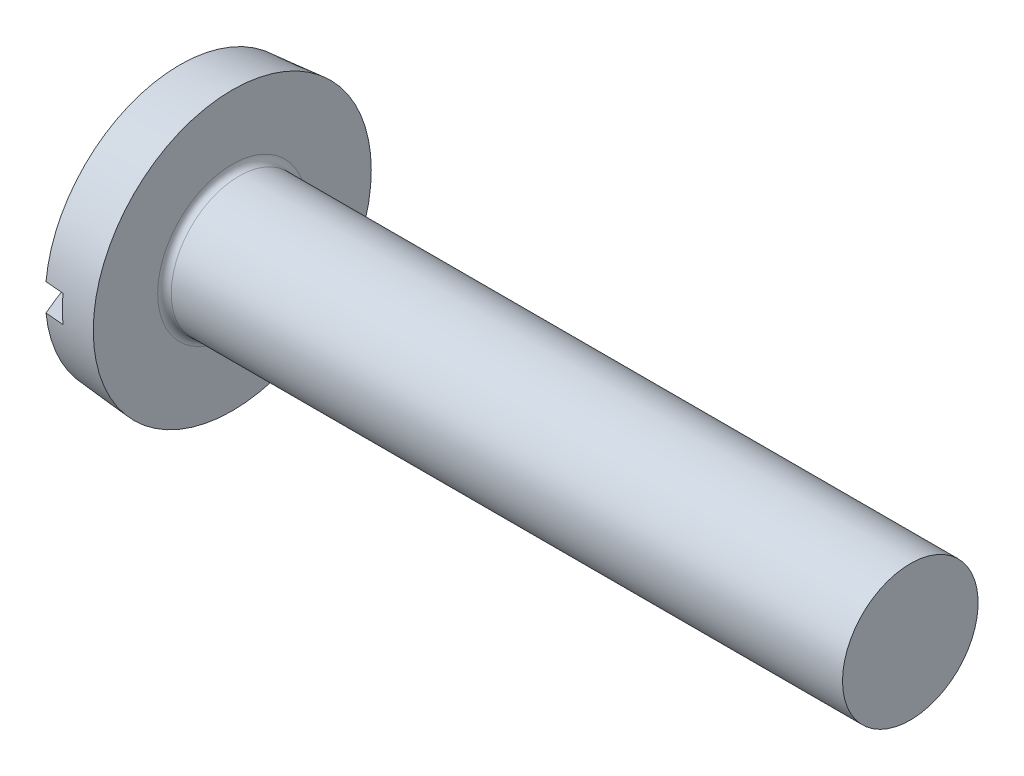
ISO-10303-21;
HEADER;
FILE_DESCRIPTION(('STEP AP214'),'2;1');
FILE_NAME('part.step','',(''),(''),'','','');
FILE_SCHEMA(('AUTOMOTIVE_DESIGN { 1 0 10303 214 1 1 1 1 }'));
ENDSEC;
DATA;
#1=APPLICATION_CONTEXT('core data for automotive mechanical design processes');
#2=APPLICATION_PROTOCOL_DEFINITION('international standard','automotive_design',2000,#1);
#3=PRODUCT_CONTEXT('',#1,'mechanical');
#4=PRODUCT('Part','Part','',(#3));
#5=PRODUCT_RELATED_PRODUCT_CATEGORY('part','',(#4));
#6=PRODUCT_DEFINITION_FORMATION('','',#4);
#7=PRODUCT_DEFINITION_CONTEXT('part definition',#1,'design');
#8=PRODUCT_DEFINITION('design','',#6,#7);
#9=PRODUCT_DEFINITION_SHAPE('','',#8);
#10=(LENGTH_UNIT() NAMED_UNIT(*) SI_UNIT(.MILLI.,.METRE.));
#11=(NAMED_UNIT(*) PLANE_ANGLE_UNIT() SI_UNIT($,.RADIAN.));
#12=(NAMED_UNIT(*) SI_UNIT($,.STERADIAN.) SOLID_ANGLE_UNIT());
#13=UNCERTAINTY_MEASURE_WITH_UNIT(LENGTH_MEASURE(1.E-05),#10,'distance_accuracy_value','');
#14=(GEOMETRIC_REPRESENTATION_CONTEXT(3) GLOBAL_UNCERTAINTY_ASSIGNED_CONTEXT((#13)) GLOBAL_UNIT_ASSIGNED_CONTEXT((#10,
#11,#12)) REPRESENTATION_CONTEXT('',''));
#15=CARTESIAN_POINT('',(0.,0.,0.));
#16=DIRECTION('',(0.,0.,1.));
#17=DIRECTION('',(1.,0.,0.));
#18=AXIS2_PLACEMENT_3D('',#15,#16,#17);
#19=CARTESIAN_POINT('',(19.3398923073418,0.,0.));
#20=DIRECTION('',(-1.,0.,0.));
#21=DIRECTION('',(0.,1.,0.));
#22=AXIS2_PLACEMENT_3D('',#19,#20,#21);
#23=SPHERICAL_SURFACE('',#22,19.3398923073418);
#24=CARTESIAN_POINT('',(19.3398923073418,0.8,0.));
#25=DIRECTION('',(0.,-1.,0.));
#26=DIRECTION('',(0.,0.,-1.));
#27=AXIS2_PLACEMENT_3D('',#24,#25,#26);
#28=CIRCLE('',#27,19.3233391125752);
#29=CARTESIAN_POINT('',(1.7,0.799999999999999,7.88832262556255));
#30=VERTEX_POINT('',#29);
#31=CARTESIAN_POINT('',(1.7,0.800000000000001,-7.88832262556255));
#32=VERTEX_POINT('',#31);
#33=EDGE_CURVE('E61',#30,#32,#28,.T.);
#34=ORIENTED_EDGE('',*,*,#33,.F.);
#35=CARTESIAN_POINT('',(1.7,0.,0.));
#36=DIRECTION('',(-1.,0.,0.));
#37=DIRECTION('',(0.,0.,1.));
#38=AXIS2_PLACEMENT_3D('',#35,#36,#37);
#39=CIRCLE('',#38,7.92878514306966);
#40=EDGE_CURVE('E105',#30,#32,#39,.T.);
#41=ORIENTED_EDGE('',*,*,#40,.T.);
#42=EDGE_LOOP('',(#34,#41));
#43=FACE_BOUND('',#42,.T.);
#44=ADVANCED_FACE('F33',(#43),#23,.T.);
#45=CARTESIAN_POINT('',(19.3398923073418,-0.8,0.));
#46=DIRECTION('',(0.,1.,0.));
#47=DIRECTION('',(0.,0.,1.));
#48=AXIS2_PLACEMENT_3D('',#45,#46,#47);
#49=CIRCLE('',#48,19.3233391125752);
#50=CARTESIAN_POINT('',(1.7,-0.799999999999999,-7.88832262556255));
#51=VERTEX_POINT('',#50);
#52=CARTESIAN_POINT('',(1.7,-0.800000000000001,7.88832262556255));
#53=VERTEX_POINT('',#52);
#54=EDGE_CURVE('E117',#51,#53,#49,.T.);
#55=ORIENTED_EDGE('',*,*,#54,.F.);
#56=EDGE_CURVE('E109',#51,#53,#39,.T.);
#57=ORIENTED_EDGE('',*,*,#56,.T.);
#58=EDGE_LOOP('',(#55,#57));
#59=FACE_BOUND('',#58,.T.);
#60=ADVANCED_FACE('F126',(#59),#23,.T.);
#61=CARTESIAN_POINT('',(4.8,0.,0.));
#62=DIRECTION('',(1.,0.,0.));
#63=DIRECTION('',(0.,0.,-1.));
#64=AXIS2_PLACEMENT_3D('',#61,#62,#63);
#65=CONICAL_SURFACE('',#64,8.2,0.0872664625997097);
#66=CARTESIAN_POINT('',(4.8,0.,0.));
#67=DIRECTION('',(-1.,0.,0.));
#68=DIRECTION('',(0.,0.,1.));
#69=AXIS2_PLACEMENT_3D('',#66,#67,#68);
#70=CIRCLE('',#69,8.2);
#71=CARTESIAN_POINT('',(4.8,0.,8.2));
#72=VERTEX_POINT('',#71);
#73=EDGE_CURVE('E110',#72,#72,#70,.T.);
#74=ORIENTED_EDGE('',*,*,#73,.T.);
#75=EDGE_LOOP('',(#74));
#76=FACE_BOUND('',#75,.T.);
#77=CARTESIAN_POINT('',(-12.4996188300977,0.800000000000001,-6.63844919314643));
#78=CARTESIAN_POINT('',(-8.41515626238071,0.800000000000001,-6.99836247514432));
#79=CARTESIAN_POINT('',(-4.33066054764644,0.800000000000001,-7.35789922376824));
#80=CARTESIAN_POINT('',(0.533772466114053,0.800000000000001,-7.78576416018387));
#81=CARTESIAN_POINT('',(1.31368676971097,0.800000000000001,-7.85435375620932));
#82=CARTESIAN_POINT('',(6.95804533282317,0.800000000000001,-8.35068030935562));
#83=CARTESIAN_POINT('',(11.8225201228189,0.800000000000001,-8.77807012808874));
#84=CARTESIAN_POINT('',(16.6870105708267,0.800000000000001,-9.20528140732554));
#85=B_SPLINE_CURVE_WITH_KNOTS('',3,(#77,#78,#79,#80,#81,#82,#83,#84),.UNSPECIFIED.,.F.,.F.,(4,2,
2,4),(0.,12.3008677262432,14.6496413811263,29.2992827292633),.UNSPECIFIED.);
#86=CARTESIAN_POINT('',(2.8,0.800000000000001,-7.98504783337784));
#87=VERTEX_POINT('',#86);
#88=EDGE_CURVE('E11',#32,#87,#85,.T.);
#89=ORIENTED_EDGE('',*,*,#88,.F.);
#90=ORIENTED_EDGE('',*,*,#40,.F.);
#91=CARTESIAN_POINT('',(16.6870105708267,0.799999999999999,9.20528140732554));
#92=CARTESIAN_POINT('',(14.2547646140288,0.799999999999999,8.99168400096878));
#93=CARTESIAN_POINT('',(11.8225232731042,0.799999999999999,8.77803401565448));
#94=CARTESIAN_POINT('',(6.95805274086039,0.799999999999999,8.35059593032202));
#95=CARTESIAN_POINT('',(4.52582354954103,0.799999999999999,8.13680783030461));
#96=CARTESIAN_POINT('',(-0.338619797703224,0.799999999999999,7.70906055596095));
#97=CARTESIAN_POINT('',(-2.77083395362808,0.799999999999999,7.49510138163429));
#98=CARTESIAN_POINT('',(-7.63524245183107,0.799999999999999,7.06695777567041));
#99=CARTESIAN_POINT('',(-10.0674367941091,0.799999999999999,6.85277334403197));
#100=CARTESIAN_POINT('',(-12.4996188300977,0.799999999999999,6.63844919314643));
#101=B_SPLINE_CURVE_WITH_KNOTS('',3,(#91,#92,#93,#94,#95,#96,#97,#98,#99,#100),.UNSPECIFIED.,
.F.,.F.,(4,2,2,2,4),(0.,7.32482069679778,14.6496413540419,21.9744620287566,29.2992827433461),.UNSPECIFIED.);
#102=CARTESIAN_POINT('',(2.8,0.799999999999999,7.98504783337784));
#103=VERTEX_POINT('',#102);
#104=EDGE_CURVE('E93',#103,#30,#101,.T.);
#105=ORIENTED_EDGE('',*,*,#104,.F.);
#106=CARTESIAN_POINT('',(2.8,0.,0.));
#107=DIRECTION('',(-1.,0.,0.));
#108=DIRECTION('',(0.,0.,1.));
#109=AXIS2_PLACEMENT_3D('',#106,#107,#108);
#110=CIRCLE('',#109,8.02502267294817);
#111=CARTESIAN_POINT('',(2.8,-0.800000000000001,7.98504783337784));
#112=VERTEX_POINT('',#111);
#113=EDGE_CURVE('E88',#112,#103,#110,.T.);
#114=ORIENTED_EDGE('',*,*,#113,.F.);
#115=CARTESIAN_POINT('',(-12.4996188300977,-0.800000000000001,6.63844919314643));
#116=CARTESIAN_POINT('',(-8.41515626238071,-0.800000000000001,6.99836247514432));
#117=CARTESIAN_POINT('',(-4.33066054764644,-0.800000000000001,7.35789922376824));
#118=CARTESIAN_POINT('',(0.533772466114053,-0.800000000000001,7.78576416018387));
#119=CARTESIAN_POINT('',(1.31368676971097,-0.800000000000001,7.85435375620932));
#120=CARTESIAN_POINT('',(6.95804533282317,-0.800000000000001,8.35068030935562));
#121=CARTESIAN_POINT('',(11.8225201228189,-0.800000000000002,8.77807012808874));
#122=CARTESIAN_POINT('',(16.6870105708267,-0.800000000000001,9.20528140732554));
#123=B_SPLINE_CURVE_WITH_KNOTS('',3,(#115,#116,#117,#118,#119,#120,#121,#122),.UNSPECIFIED.,.F.,
.F.,(4,2,2,4),(0.,12.3008677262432,14.6496413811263,29.2992827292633),.UNSPECIFIED.);
#124=EDGE_CURVE('E95',#53,#112,#123,.T.);
#125=ORIENTED_EDGE('',*,*,#124,.F.);
#126=ORIENTED_EDGE('',*,*,#56,.F.);
#127=CARTESIAN_POINT('',(16.6870105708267,-0.799999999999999,-9.20528140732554));
#128=CARTESIAN_POINT('',(14.2547646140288,-0.799999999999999,-8.99168400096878));
#129=CARTESIAN_POINT('',(11.8225232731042,-0.799999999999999,-8.77803401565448));
#130=CARTESIAN_POINT('',(6.95805274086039,-0.799999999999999,-8.35059593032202));
#131=CARTESIAN_POINT('',(4.52582354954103,-0.799999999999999,-8.13680783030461));
#132=CARTESIAN_POINT('',(-0.338619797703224,-0.799999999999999,-7.70906055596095));
#133=CARTESIAN_POINT('',(-2.77083395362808,-0.799999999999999,-7.49510138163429));
#134=CARTESIAN_POINT('',(-7.63524245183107,-0.799999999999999,-7.06695777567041));
#135=CARTESIAN_POINT('',(-10.0674367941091,-0.799999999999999,-6.85277334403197));
#136=CARTESIAN_POINT('',(-12.4996188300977,-0.799999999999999,-6.63844919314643));
#137=B_SPLINE_CURVE_WITH_KNOTS('',3,(#127,#128,#129,#130,#131,#132,#133,#134,#135,#136),
.UNSPECIFIED.,.F.,.F.,(4,2,2,2,4),(0.,7.32482069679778,14.6496413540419,21.9744620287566,
29.2992827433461),.UNSPECIFIED.);
#138=CARTESIAN_POINT('',(2.8,-0.799999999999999,-7.98504783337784));
#139=VERTEX_POINT('',#138);
#140=EDGE_CURVE('E47',#139,#51,#137,.T.);
#141=ORIENTED_EDGE('',*,*,#140,.F.);
#142=EDGE_CURVE('E86',#87,#139,#110,.T.);
#143=ORIENTED_EDGE('',*,*,#142,.F.);
#144=EDGE_LOOP('',(#89,#90,#105,#114,#125,#126,#141,#143));
#145=FACE_BOUND('',#144,.T.);
#146=ADVANCED_FACE('F91',(#76,#145),#65,.T.);
#147=CARTESIAN_POINT('',(4.8,8.2,0.));
#148=DIRECTION('',(-1.,0.,0.));
#149=DIRECTION('',(0.,0.,1.));
#150=AXIS2_PLACEMENT_3D('',#147,#148,#149);
#151=PLANE('',#150);
#152=CARTESIAN_POINT('',(4.8,0.,0.));
#153=DIRECTION('',(-1.,0.,0.));
#154=DIRECTION('',(0.,0.,1.));
#155=AXIS2_PLACEMENT_3D('',#152,#153,#154);
#156=CIRCLE('',#155,4.4);
#157=CARTESIAN_POINT('',(4.8,0.,4.4));
#158=VERTEX_POINT('',#157);
#159=EDGE_CURVE('E101',#158,#158,#156,.T.);
#160=ORIENTED_EDGE('',*,*,#159,.T.);
#161=EDGE_LOOP('',(#160));
#162=FACE_BOUND('',#161,.T.);
#163=ORIENTED_EDGE('',*,*,#73,.F.);
#164=EDGE_LOOP('',(#163));
#165=FACE_BOUND('',#164,.T.);
#166=ADVANCED_FACE('F134',(#162,#165),#151,.F.);
#167=CARTESIAN_POINT('',(0.,0.,0.));
#168=DIRECTION('',(-1.,0.,0.));
#169=DIRECTION('',(0.,0.,1.));
#170=AXIS2_PLACEMENT_3D('',#167,#168,#169);
#171=CYLINDRICAL_SURFACE('',#170,4.);
#172=CARTESIAN_POINT('',(5.2,0.,0.));
#173=DIRECTION('',(-1.,0.,0.));
#174=DIRECTION('',(0.,0.,1.));
#175=AXIS2_PLACEMENT_3D('',#172,#173,#174);
#176=CIRCLE('',#175,4.);
#177=CARTESIAN_POINT('',(5.2,0.,4.));
#178=VERTEX_POINT('',#177);
#179=EDGE_CURVE('E99',#178,#178,#176,.F.);
#180=ORIENTED_EDGE('',*,*,#179,.T.);
#181=EDGE_LOOP('',(#180));
#182=FACE_BOUND('',#181,.T.);
#183=CARTESIAN_POINT('',(44.8,0.,0.));
#184=DIRECTION('',(-1.,0.,0.));
#185=DIRECTION('',(0.,0.,1.));
#186=AXIS2_PLACEMENT_3D('',#183,#184,#185);
#187=CIRCLE('',#186,4.);
#188=CARTESIAN_POINT('',(44.8,0.,4.));
#189=VERTEX_POINT('',#188);
#190=EDGE_CURVE('E113',#189,#189,#187,.T.);
#191=ORIENTED_EDGE('',*,*,#190,.T.);
#192=EDGE_LOOP('',(#191));
#193=FACE_BOUND('',#192,.T.);
#194=ADVANCED_FACE('F163',(#182,#193),#171,.T.);
#195=CARTESIAN_POINT('',(44.8,4.,0.));
#196=DIRECTION('',(-1.,0.,0.));
#197=DIRECTION('',(0.,0.,1.));
#198=AXIS2_PLACEMENT_3D('',#195,#196,#197);
#199=PLANE('',#198);
#200=ORIENTED_EDGE('',*,*,#190,.F.);
#201=EDGE_LOOP('',(#200));
#202=FACE_BOUND('',#201,.T.);
#203=ADVANCED_FACE('F160',(#202),#199,.F.);
#204=CARTESIAN_POINT('',(5.2,0.,0.));
#205=DIRECTION('',(-1.,0.,0.));
#206=DIRECTION('',(0.,0.,1.));
#207=AXIS2_PLACEMENT_3D('',#204,#205,#206);
#208=TOROIDAL_SURFACE('',#207,4.4,0.4);
#209=ORIENTED_EDGE('',*,*,#179,.F.);
#210=EDGE_LOOP('',(#209));
#211=FACE_BOUND('',#210,.T.);
#212=ORIENTED_EDGE('',*,*,#159,.F.);
#213=EDGE_LOOP('',(#212));
#214=FACE_BOUND('',#213,.T.);
#215=ADVANCED_FACE('F35',(#211,#214),#208,.F.);
#216=CARTESIAN_POINT('',(2.8,0.800000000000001,-8.2));
#217=DIRECTION('',(0.,-1.,0.));
#218=DIRECTION('',(0.,0.,-1.));
#219=AXIS2_PLACEMENT_3D('',#216,#217,#218);
#220=PLANE('',#219);
#221=ORIENTED_EDGE('',*,*,#88,.T.);
#222=DIRECTION('',(0.,0.,1.));
#223=VECTOR('',#222,1.);
#224=CARTESIAN_POINT('',(2.8,0.800000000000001,-8.2));
#225=LINE('',#224,#223);
#226=EDGE_CURVE('E79',#87,#103,#225,.T.);
#227=ORIENTED_EDGE('',*,*,#226,.T.);
#228=ORIENTED_EDGE('',*,*,#104,.T.);
#229=ORIENTED_EDGE('',*,*,#33,.T.);
#230=EDGE_LOOP('',(#221,#227,#228,#229));
#231=FACE_BOUND('',#230,.T.);
#232=ADVANCED_FACE('F78',(#231),#220,.T.);
#233=CARTESIAN_POINT('',(2.8,-0.799999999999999,-8.2));
#234=DIRECTION('',(0.,1.,0.));
#235=DIRECTION('',(0.,0.,1.));
#236=AXIS2_PLACEMENT_3D('',#233,#234,#235);
#237=PLANE('',#236);
#238=ORIENTED_EDGE('',*,*,#140,.T.);
#239=ORIENTED_EDGE('',*,*,#54,.T.);
#240=ORIENTED_EDGE('',*,*,#124,.T.);
#241=DIRECTION('',(0.,0.,-1.));
#242=VECTOR('',#241,1.);
#243=CARTESIAN_POINT('',(2.8,-0.799999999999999,-8.2));
#244=LINE('',#243,#242);
#245=EDGE_CURVE('E54',#112,#139,#244,.T.);
#246=ORIENTED_EDGE('',*,*,#245,.T.);
#247=EDGE_LOOP('',(#238,#239,#240,#246));
#248=FACE_BOUND('',#247,.T.);
#249=ADVANCED_FACE('F120',(#248),#237,.T.);
#250=CARTESIAN_POINT('',(2.8,-0.799999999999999,-8.2));
#251=DIRECTION('',(-1.,0.,0.));
#252=DIRECTION('',(0.,0.,1.));
#253=AXIS2_PLACEMENT_3D('',#250,#251,#252);
#254=PLANE('',#253);
#255=ORIENTED_EDGE('',*,*,#142,.T.);
#256=ORIENTED_EDGE('',*,*,#245,.F.);
#257=ORIENTED_EDGE('',*,*,#113,.T.);
#258=ORIENTED_EDGE('',*,*,#226,.F.);
#259=EDGE_LOOP('',(#255,#256,#257,#258));
#260=FACE_BOUND('',#259,.T.);
#261=ADVANCED_FACE('F85',(#260),#254,.T.);
#262=CLOSED_SHELL('',(#44,#60,#146,#166,#194,#203,#215,#232,#249,#261));
#263=MANIFOLD_SOLID_BREP('B2',#262);
#264=ADVANCED_BREP_SHAPE_REPRESENTATION('',(#18,#263),#14);
#265=SHAPE_DEFINITION_REPRESENTATION(#9,#264);
ENDSEC;
END-ISO-10303-21;
